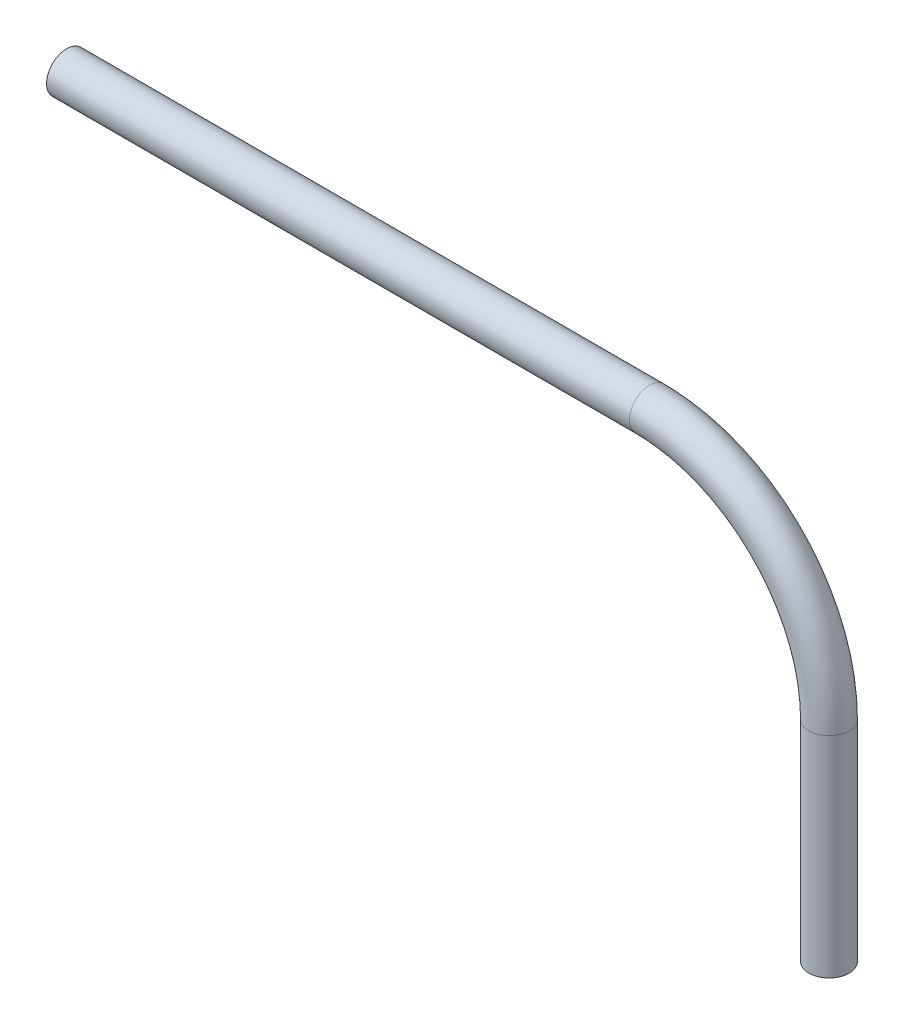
ISO-10303-21;
HEADER;
FILE_DESCRIPTION(('STEP AP214'),'2;1');
FILE_NAME('part.step','',(''),(''),'','','');
FILE_SCHEMA(('AUTOMOTIVE_DESIGN { 1 0 10303 214 1 1 1 1 }'));
ENDSEC;
DATA;
#1=APPLICATION_CONTEXT('core data for automotive mechanical design processes');
#2=APPLICATION_PROTOCOL_DEFINITION('international standard','automotive_design',2000,#1);
#3=PRODUCT_CONTEXT('',#1,'mechanical');
#4=PRODUCT('Part','Part','',(#3));
#5=PRODUCT_RELATED_PRODUCT_CATEGORY('part','',(#4));
#6=PRODUCT_DEFINITION_FORMATION('','',#4);
#7=PRODUCT_DEFINITION_CONTEXT('part definition',#1,'design');
#8=PRODUCT_DEFINITION('design','',#6,#7);
#9=PRODUCT_DEFINITION_SHAPE('','',#8);
#10=(LENGTH_UNIT() NAMED_UNIT(*) SI_UNIT(.MILLI.,.METRE.));
#11=(NAMED_UNIT(*) PLANE_ANGLE_UNIT() SI_UNIT($,.RADIAN.));
#12=(NAMED_UNIT(*) SI_UNIT($,.STERADIAN.) SOLID_ANGLE_UNIT());
#13=UNCERTAINTY_MEASURE_WITH_UNIT(LENGTH_MEASURE(1.E-05),#10,'distance_accuracy_value','');
#14=(GEOMETRIC_REPRESENTATION_CONTEXT(3) GLOBAL_UNCERTAINTY_ASSIGNED_CONTEXT((#13)) GLOBAL_UNIT_ASSIGNED_CONTEXT((#10,
#11,#12)) REPRESENTATION_CONTEXT('',''));
#15=CARTESIAN_POINT('',(0.,0.,0.));
#16=DIRECTION('',(0.,0.,1.));
#17=DIRECTION('',(1.,0.,0.));
#18=AXIS2_PLACEMENT_3D('',#15,#16,#17);
#19=CARTESIAN_POINT('',(653.971612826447,77.704053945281,0.));
#20=DIRECTION('',(0.,1.,0.));
#21=DIRECTION('',(0.,0.,1.));
#22=AXIS2_PLACEMENT_3D('',#19,#20,#21);
#23=CYLINDRICAL_SURFACE('',#22,14.5000000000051);
#24=CARTESIAN_POINT('',(653.971612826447,77.704053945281,0.));
#25=DIRECTION('',(0.,1.,0.));
#26=DIRECTION('',(0.,0.,1.));
#27=AXIS2_PLACEMENT_3D('',#24,#25,#26);
#28=CIRCLE('',#27,14.5000000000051);
#29=CARTESIAN_POINT('',(653.971612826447,77.704053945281,14.5000000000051));
#30=VERTEX_POINT('',#29);
#31=EDGE_CURVE('E18',#30,#30,#28,.T.);
#32=ORIENTED_EDGE('',*,*,#31,.F.);
#33=EDGE_LOOP('',(#32));
#34=FACE_BOUND('',#33,.T.);
#35=CARTESIAN_POINT('',(653.971612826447,257.704053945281,0.));
#36=DIRECTION('',(0.,1.,0.));
#37=DIRECTION('',(1.,0.,0.));
#38=AXIS2_PLACEMENT_3D('',#35,#36,#37);
#39=CIRCLE('',#38,14.5000000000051);
#40=CARTESIAN_POINT('',(668.471612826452,257.704053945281,0.));
#41=VERTEX_POINT('',#40);
#42=EDGE_CURVE('E66',#41,#41,#39,.T.);
#43=ORIENTED_EDGE('',*,*,#42,.T.);
#44=EDGE_LOOP('',(#43));
#45=FACE_BOUND('',#44,.T.);
#46=ADVANCED_FACE('F15',(#34,#45),#23,.F.);
#47=CARTESIAN_POINT('',(500.,257.704053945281,0.));
#48=DIRECTION('',(0.,0.,1.));
#49=DIRECTION('',(1.,0.,0.));
#50=AXIS2_PLACEMENT_3D('',#47,#48,#49);
#51=TOROIDAL_SURFACE('',#50,153.971612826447,14.5000000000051);
#52=ORIENTED_EDGE('',*,*,#42,.F.);
#53=EDGE_LOOP('',(#52));
#54=FACE_BOUND('',#53,.T.);
#55=CARTESIAN_POINT('',(500.,411.675666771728,0.));
#56=DIRECTION('',(-1.,0.,0.));
#57=DIRECTION('',(0.,0.,1.));
#58=AXIS2_PLACEMENT_3D('',#55,#56,#57);
#59=CIRCLE('',#58,14.5000000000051);
#60=CARTESIAN_POINT('',(500.,411.675666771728,14.5000000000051));
#61=VERTEX_POINT('',#60);
#62=EDGE_CURVE('E75',#61,#61,#59,.T.);
#63=ORIENTED_EDGE('',*,*,#62,.T.);
#64=EDGE_LOOP('',(#63));
#65=FACE_BOUND('',#64,.T.);
#66=ADVANCED_FACE('F56',(#54,#65),#51,.F.);
#67=CARTESIAN_POINT('',(653.971612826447,77.704053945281,0.));
#68=DIRECTION('',(0.,-1.,0.));
#69=DIRECTION('',(0.,0.,-1.));
#70=AXIS2_PLACEMENT_3D('',#67,#68,#69);
#71=PLANE('',#70);
#72=CARTESIAN_POINT('',(653.971612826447,77.704053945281,0.));
#73=DIRECTION('',(0.,1.,0.));
#74=DIRECTION('',(0.,0.,1.));
#75=AXIS2_PLACEMENT_3D('',#72,#73,#74);
#76=CIRCLE('',#75,17.2500000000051);
#77=CARTESIAN_POINT('',(653.971612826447,77.704053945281,17.2500000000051));
#78=VERTEX_POINT('',#77);
#79=EDGE_CURVE('E73',#78,#78,#76,.T.);
#80=ORIENTED_EDGE('',*,*,#79,.F.);
#81=EDGE_LOOP('',(#80));
#82=FACE_BOUND('',#81,.T.);
#83=ORIENTED_EDGE('',*,*,#31,.T.);
#84=EDGE_LOOP('',(#83));
#85=FACE_BOUND('',#84,.T.);
#86=ADVANCED_FACE('F53',(#82,#85),#71,.T.);
#87=CARTESIAN_POINT('',(500.,411.675666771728,0.));
#88=DIRECTION('',(-1.,0.,0.));
#89=DIRECTION('',(0.,0.,1.));
#90=AXIS2_PLACEMENT_3D('',#87,#88,#89);
#91=CYLINDRICAL_SURFACE('',#90,14.5000000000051);
#92=ORIENTED_EDGE('',*,*,#62,.F.);
#93=EDGE_LOOP('',(#92));
#94=FACE_BOUND('',#93,.T.);
#95=CARTESIAN_POINT('',(0.,411.675666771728,0.));
#96=DIRECTION('',(-1.,0.,0.));
#97=DIRECTION('',(0.,0.,1.));
#98=AXIS2_PLACEMENT_3D('',#95,#96,#97);
#99=CIRCLE('',#98,14.5000000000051);
#100=CARTESIAN_POINT('',(0.,411.675666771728,14.5000000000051));
#101=VERTEX_POINT('',#100);
#102=EDGE_CURVE('E71',#101,#101,#99,.T.);
#103=ORIENTED_EDGE('',*,*,#102,.T.);
#104=EDGE_LOOP('',(#103));
#105=FACE_BOUND('',#104,.T.);
#106=ADVANCED_FACE('F49',(#94,#105),#91,.F.);
#107=CARTESIAN_POINT('',(653.971612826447,77.704053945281,0.));
#108=DIRECTION('',(0.,1.,0.));
#109=DIRECTION('',(0.,0.,1.));
#110=AXIS2_PLACEMENT_3D('',#107,#108,#109);
#111=CYLINDRICAL_SURFACE('',#110,17.2500000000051);
#112=ORIENTED_EDGE('',*,*,#79,.T.);
#113=EDGE_LOOP('',(#112));
#114=FACE_BOUND('',#113,.T.);
#115=CARTESIAN_POINT('',(653.971612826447,257.704053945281,0.));
#116=DIRECTION('',(0.,1.,0.));
#117=DIRECTION('',(1.,0.,0.));
#118=AXIS2_PLACEMENT_3D('',#115,#116,#117);
#119=CIRCLE('',#118,17.2500000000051);
#120=CARTESIAN_POINT('',(671.221612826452,257.704053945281,0.));
#121=VERTEX_POINT('',#120);
#122=EDGE_CURVE('E27',#121,#121,#119,.T.);
#123=ORIENTED_EDGE('',*,*,#122,.F.);
#124=EDGE_LOOP('',(#123));
#125=FACE_BOUND('',#124,.T.);
#126=ADVANCED_FACE('F45',(#114,#125),#111,.T.);
#127=CARTESIAN_POINT('',(0.,411.675666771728,0.));
#128=DIRECTION('',(1.,0.,0.));
#129=DIRECTION('',(0.,0.,-1.));
#130=AXIS2_PLACEMENT_3D('',#127,#128,#129);
#131=PLANE('',#130);
#132=CARTESIAN_POINT('',(0.,411.675666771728,0.));
#133=DIRECTION('',(-1.,0.,0.));
#134=DIRECTION('',(0.,0.,1.));
#135=AXIS2_PLACEMENT_3D('',#132,#133,#134);
#136=CIRCLE('',#135,17.2500000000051);
#137=CARTESIAN_POINT('',(0.,411.675666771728,17.2500000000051));
#138=VERTEX_POINT('',#137);
#139=EDGE_CURVE('E22',#138,#138,#136,.F.);
#140=ORIENTED_EDGE('',*,*,#139,.F.);
#141=EDGE_LOOP('',(#140));
#142=FACE_BOUND('',#141,.T.);
#143=ORIENTED_EDGE('',*,*,#102,.F.);
#144=EDGE_LOOP('',(#143));
#145=FACE_BOUND('',#144,.T.);
#146=ADVANCED_FACE('F41',(#142,#145),#131,.F.);
#147=CARTESIAN_POINT('',(500.,257.704053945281,0.));
#148=DIRECTION('',(0.,0.,1.));
#149=DIRECTION('',(1.,0.,0.));
#150=AXIS2_PLACEMENT_3D('',#147,#148,#149);
#151=TOROIDAL_SURFACE('',#150,153.971612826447,17.2500000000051);
#152=ORIENTED_EDGE('',*,*,#122,.T.);
#153=EDGE_LOOP('',(#152));
#154=FACE_BOUND('',#153,.T.);
#155=CARTESIAN_POINT('',(500.,411.675666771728,0.));
#156=DIRECTION('',(-1.,0.,0.));
#157=DIRECTION('',(0.,0.,1.));
#158=AXIS2_PLACEMENT_3D('',#155,#156,#157);
#159=CIRCLE('',#158,17.2500000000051);
#160=CARTESIAN_POINT('',(500.,411.675666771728,17.2500000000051));
#161=VERTEX_POINT('',#160);
#162=EDGE_CURVE('E10',#161,#161,#159,.T.);
#163=ORIENTED_EDGE('',*,*,#162,.F.);
#164=EDGE_LOOP('',(#163));
#165=FACE_BOUND('',#164,.T.);
#166=ADVANCED_FACE('F36',(#154,#165),#151,.T.);
#167=CARTESIAN_POINT('',(500.,411.675666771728,0.));
#168=DIRECTION('',(-1.,0.,0.));
#169=DIRECTION('',(0.,0.,1.));
#170=AXIS2_PLACEMENT_3D('',#167,#168,#169);
#171=CYLINDRICAL_SURFACE('',#170,17.2500000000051);
#172=ORIENTED_EDGE('',*,*,#162,.T.);
#173=EDGE_LOOP('',(#172));
#174=FACE_BOUND('',#173,.T.);
#175=ORIENTED_EDGE('',*,*,#139,.T.);
#176=EDGE_LOOP('',(#175));
#177=FACE_BOUND('',#176,.T.);
#178=ADVANCED_FACE('F40',(#174,#177),#171,.T.);
#179=CLOSED_SHELL('',(#46,#66,#86,#106,#126,#146,#166,#178));
#180=MANIFOLD_SOLID_BREP('B1',#179);
#181=ADVANCED_BREP_SHAPE_REPRESENTATION('',(#18,#180),#14);
#182=SHAPE_DEFINITION_REPRESENTATION(#9,#181);
ENDSEC;
END-ISO-10303-21;
